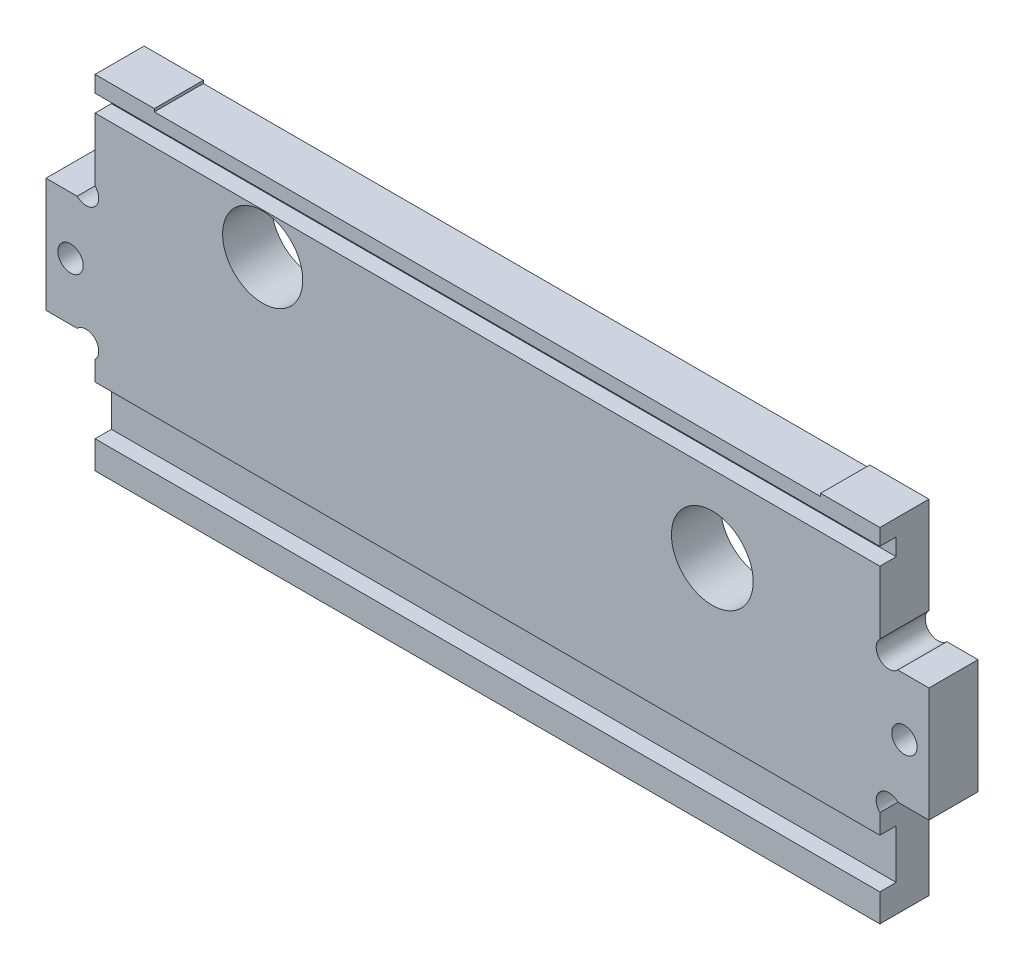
from build123d import *

# Parameters (mm, degrees)
ESQUISSE1_R             = 5
ESQUISSE1_R_2           = 1.55
ESQUISSE1_R_3           = 4.9
EXTRUSION1_DEPTH        = 6
ESQUISSE2_W             = 99.747849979
ESQUISSE2_H             = 2.1
ESQUISSE2_W_2           = 98.997239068
ESQUISSE2_H_2           = 6
ENL_V_MAT_EXTRU_1_DEPTH = 2


with BuildPart() as part:
    # Esquisse1 → Extrusion1 (new body)
    with BuildSketch(Plane.XY):
        with BuildLine():
            Line((6, 42), (13.25, 42))
            Line((13.25, 42), (13.25, 41.65))
            Line((13.25, 41.65), (94.75, 41.65))
            Line((94.75, 41.65), (94.75, 42))
            Line((94.75, 42), (102, 42))
            Line((102, 42), (102, 30.192031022))
            ThreePointArc((102, 30.192031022), (102, 28), (104.192031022, 28))
            Line((104.192031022, 28), (108, 28))
            Line((108, 28), (108, 14))
            Line((108, 14), (104.192031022, 14))
            ThreePointArc((104.192031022, 14), (102, 14), (102, 11.807968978))
            Line((102, 11.807968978), (102, 0))
            Line((102, 0), (6, 0))
            Line((6, 0), (6, 11.807968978))
            ThreePointArc((6, 11.807968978), (6, 14), (3.807968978, 14))
            Line((3.807968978, 14), (0, 14))
            Line((0, 14), (0, 28))
            Line((0, 28), (3.807968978, 28))
            ThreePointArc((3.807968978, 28), (6, 28), (6, 30.192031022))
            Line((6, 30.192031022), (6, 42))
        make_face()
        with Locations((81.5, 28.5)):
            Circle(ESQUISSE1_R, mode=Mode.SUBTRACT)
        with Locations((3, 21)):
            Circle(ESQUISSE1_R_2, mode=Mode.SUBTRACT)
        with Locations(Location((105, 21, 0), (0, 0, 180))):
            Circle(ESQUISSE1_R_2, mode=Mode.SUBTRACT)
        with Locations((26.5, 32.9)):
            Circle(ESQUISSE1_R_3, mode=Mode.SUBTRACT)
    extrude(amount=EXTRUSION1_DEPTH)

    # Esquisse2 → Enl_v. mat.-Extru.1 (cut)
    with BuildSketch(Plane.XY.offset(6)):
        with Locations((54.222300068, 38.95)):
            Rectangle(ESQUISSE2_W, ESQUISSE2_H)
        with Locations((53.846994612, 6.4)):
            Rectangle(ESQUISSE2_W_2, ESQUISSE2_H_2)
    extrude(amount=-ENL_V_MAT_EXTRU_1_DEPTH, mode=Mode.SUBTRACT)


solid = part.part
